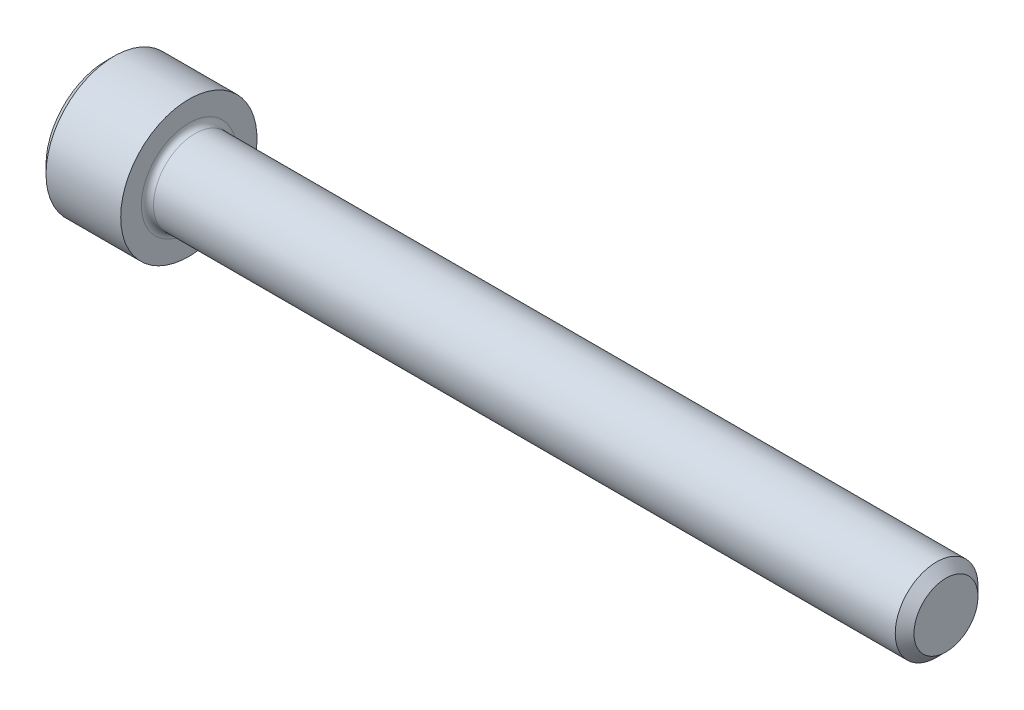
ISO-10303-21;
HEADER;
FILE_DESCRIPTION(('STEP AP214'),'2;1');
FILE_NAME('part.step','',(''),(''),'','','');
FILE_SCHEMA(('AUTOMOTIVE_DESIGN { 1 0 10303 214 1 1 1 1 }'));
ENDSEC;
DATA;
#1=APPLICATION_CONTEXT('core data for automotive mechanical design processes');
#2=APPLICATION_PROTOCOL_DEFINITION('international standard','automotive_design',2000,#1);
#3=PRODUCT_CONTEXT('',#1,'mechanical');
#4=PRODUCT('Part','Part','',(#3));
#5=PRODUCT_RELATED_PRODUCT_CATEGORY('part','',(#4));
#6=PRODUCT_DEFINITION_FORMATION('','',#4);
#7=PRODUCT_DEFINITION_CONTEXT('part definition',#1,'design');
#8=PRODUCT_DEFINITION('design','',#6,#7);
#9=PRODUCT_DEFINITION_SHAPE('','',#8);
#10=(LENGTH_UNIT() NAMED_UNIT(*) SI_UNIT(.MILLI.,.METRE.));
#11=(NAMED_UNIT(*) PLANE_ANGLE_UNIT() SI_UNIT($,.RADIAN.));
#12=(NAMED_UNIT(*) SI_UNIT($,.STERADIAN.) SOLID_ANGLE_UNIT());
#13=UNCERTAINTY_MEASURE_WITH_UNIT(LENGTH_MEASURE(1.E-05),#10,'distance_accuracy_value','');
#14=(GEOMETRIC_REPRESENTATION_CONTEXT(3) GLOBAL_UNCERTAINTY_ASSIGNED_CONTEXT((#13)) GLOBAL_UNIT_ASSIGNED_CONTEXT((#10,
#11,#12)) REPRESENTATION_CONTEXT('',''));
#15=CARTESIAN_POINT('',(0.,0.,0.));
#16=DIRECTION('',(0.,0.,1.));
#17=DIRECTION('',(1.,0.,0.));
#18=AXIS2_PLACEMENT_3D('',#15,#16,#17);
#19=CARTESIAN_POINT('',(0.,0.,0.));
#20=DIRECTION('',(-1.,0.,0.));
#21=DIRECTION('',(0.,0.,1.));
#22=AXIS2_PLACEMENT_3D('',#19,#20,#21);
#23=PLANE('',#22);
#24=DIRECTION('',(0.,-0.499999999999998,0.86602540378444));
#25=VECTOR('',#24,1.);
#26=CARTESIAN_POINT('',(0.,2.05305755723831,0.));
#27=LINE('',#26,#25);
#28=CARTESIAN_POINT('',(0.,2.05305755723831,0.));
#29=VERTEX_POINT('',#28);
#30=CARTESIAN_POINT('',(0.,1.02652877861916,1.778));
#31=VERTEX_POINT('',#30);
#32=EDGE_CURVE('E402',#29,#31,#27,.T.);
#33=ORIENTED_EDGE('',*,*,#32,.T.);
#34=DIRECTION('',(0.,1.,0.));
#35=VECTOR('',#34,1.);
#36=CARTESIAN_POINT('',(0.,-1.02652877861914,1.778));
#37=LINE('',#36,#35);
#38=CARTESIAN_POINT('',(0.,-1.02652877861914,1.778));
#39=VERTEX_POINT('',#38);
#40=EDGE_CURVE('E149',#39,#31,#37,.T.);
#41=ORIENTED_EDGE('',*,*,#40,.F.);
#42=DIRECTION('',(0.,-0.500000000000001,-0.866025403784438));
#43=VECTOR('',#42,1.);
#44=CARTESIAN_POINT('',(0.,-1.02652877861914,1.778));
#45=LINE('',#44,#43);
#46=CARTESIAN_POINT('',(0.,-2.0530575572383,0.));
#47=VERTEX_POINT('',#46);
#48=EDGE_CURVE('E407',#39,#47,#45,.T.);
#49=ORIENTED_EDGE('',*,*,#48,.T.);
#50=DIRECTION('',(0.,0.499999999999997,-0.86602540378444));
#51=VECTOR('',#50,1.);
#52=CARTESIAN_POINT('',(0.,-2.0530575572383,0.));
#53=LINE('',#52,#51);
#54=CARTESIAN_POINT('',(0.,-1.02652877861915,-1.778));
#55=VERTEX_POINT('',#54);
#56=EDGE_CURVE('E411',#47,#55,#53,.T.);
#57=ORIENTED_EDGE('',*,*,#56,.T.);
#58=DIRECTION('',(0.,-1.,0.));
#59=VECTOR('',#58,1.);
#60=CARTESIAN_POINT('',(0.,1.02652877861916,-1.778));
#61=LINE('',#60,#59);
#62=CARTESIAN_POINT('',(0.,1.02652877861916,-1.778));
#63=VERTEX_POINT('',#62);
#64=EDGE_CURVE('E415',#63,#55,#61,.T.);
#65=ORIENTED_EDGE('',*,*,#64,.F.);
#66=DIRECTION('',(0.,-0.500000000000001,-0.866025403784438));
#67=VECTOR('',#66,1.);
#68=CARTESIAN_POINT('',(0.,2.05305755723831,0.));
#69=LINE('',#68,#67);
#70=EDGE_CURVE('E144',#29,#63,#69,.T.);
#71=ORIENTED_EDGE('',*,*,#70,.F.);
#72=EDGE_LOOP('',(#33,#41,#49,#57,#65,#71));
#73=FACE_BOUND('',#72,.T.);
#74=CARTESIAN_POINT('',(0.,0.,0.));
#75=DIRECTION('',(-1.,0.,0.));
#76=DIRECTION('',(0.,0.,1.));
#77=AXIS2_PLACEMENT_3D('',#74,#75,#76);
#78=CIRCLE('',#77,3.0226);
#79=CARTESIAN_POINT('',(0.,0.,3.0226));
#80=VERTEX_POINT('',#79);
#81=EDGE_CURVE('E164',#80,#80,#78,.T.);
#82=ORIENTED_EDGE('',*,*,#81,.T.);
#83=EDGE_LOOP('',(#82));
#84=FACE_BOUND('',#83,.T.);
#85=ADVANCED_FACE('F37',(#73,#84),#23,.T.);
#86=CARTESIAN_POINT('',(42.2656,1.61036,0.));
#87=DIRECTION('',(1.,0.,0.));
#88=DIRECTION('',(0.,0.,-1.));
#89=AXIS2_PLACEMENT_3D('',#86,#87,#88);
#90=PLANE('',#89);
#91=CARTESIAN_POINT('',(42.2656,0.,0.));
#92=DIRECTION('',(-1.,0.,0.));
#93=DIRECTION('',(0.,0.,1.));
#94=AXIS2_PLACEMENT_3D('',#91,#92,#93);
#95=CIRCLE('',#94,1.61036);
#96=CARTESIAN_POINT('',(42.2656,0.,1.61036));
#97=VERTEX_POINT('',#96);
#98=EDGE_CURVE('E180',#97,#97,#95,.T.);
#99=ORIENTED_EDGE('',*,*,#98,.F.);
#100=EDGE_LOOP('',(#99));
#101=FACE_BOUND('',#100,.T.);
#102=ADVANCED_FACE('F202',(#101),#90,.T.);
#103=CARTESIAN_POINT('',(42.2656,0.,0.));
#104=DIRECTION('',(-1.,0.,0.));
#105=DIRECTION('',(0.,0.,1.));
#106=AXIS2_PLACEMENT_3D('',#103,#104,#105);
#107=CONICAL_SURFACE('',#106,1.61036,0.785398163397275);
#108=CARTESIAN_POINT('',(41.7931599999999,0.,0.));
#109=DIRECTION('',(-1.,0.,0.));
#110=DIRECTION('',(0.,0.,1.));
#111=AXIS2_PLACEMENT_3D('',#108,#109,#110);
#112=CIRCLE('',#111,2.08279999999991);
#113=CARTESIAN_POINT('',(41.7931599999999,0.,2.08279999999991));
#114=VERTEX_POINT('',#113);
#115=EDGE_CURVE('E177',#114,#114,#112,.T.);
#116=ORIENTED_EDGE('',*,*,#115,.F.);
#117=EDGE_LOOP('',(#116));
#118=FACE_BOUND('',#117,.T.);
#119=ORIENTED_EDGE('',*,*,#98,.T.);
#120=EDGE_LOOP('',(#119));
#121=FACE_BOUND('',#120,.T.);
#122=ADVANCED_FACE('F208',(#118,#121),#107,.T.);
#123=CARTESIAN_POINT('',(-31.75,0.,0.));
#124=DIRECTION('',(-1.,0.,0.));
#125=DIRECTION('',(0.,0.,1.));
#126=AXIS2_PLACEMENT_3D('',#123,#124,#125);
#127=CYLINDRICAL_SURFACE('',#126,2.08279999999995);
#128=CARTESIAN_POINT('',(4.4704,0.,0.));
#129=DIRECTION('',(1.,0.,0.));
#130=DIRECTION('',(0.,0.,-1.));
#131=AXIS2_PLACEMENT_3D('',#128,#129,#130);
#132=CIRCLE('',#131,2.08279999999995);
#133=CARTESIAN_POINT('',(4.4704,0.,-2.08279999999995));
#134=VERTEX_POINT('',#133);
#135=EDGE_CURVE('E11',#134,#134,#132,.T.);
#136=ORIENTED_EDGE('',*,*,#135,.T.);
#137=EDGE_LOOP('',(#136));
#138=FACE_BOUND('',#137,.T.);
#139=ORIENTED_EDGE('',*,*,#115,.T.);
#140=EDGE_LOOP('',(#139));
#141=FACE_BOUND('',#140,.T.);
#142=ADVANCED_FACE('F219',(#138,#141),#127,.T.);
#143=CARTESIAN_POINT('',(4.1656,3.429,0.));
#144=DIRECTION('',(1.,0.,0.));
#145=DIRECTION('',(0.,0.,-1.));
#146=AXIS2_PLACEMENT_3D('',#143,#144,#145);
#147=PLANE('',#146);
#148=CARTESIAN_POINT('',(4.1656,0.,0.));
#149=DIRECTION('',(1.,0.,0.));
#150=DIRECTION('',(0.,0.,-1.));
#151=AXIS2_PLACEMENT_3D('',#148,#149,#150);
#152=CIRCLE('',#151,2.38759999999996);
#153=CARTESIAN_POINT('',(4.1656,0.,-2.38759999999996));
#154=VERTEX_POINT('',#153);
#155=EDGE_CURVE('E46',#154,#154,#152,.F.);
#156=ORIENTED_EDGE('',*,*,#155,.T.);
#157=EDGE_LOOP('',(#156));
#158=FACE_BOUND('',#157,.T.);
#159=CARTESIAN_POINT('',(4.1656,0.,0.));
#160=DIRECTION('',(-1.,0.,0.));
#161=DIRECTION('',(0.,0.,1.));
#162=AXIS2_PLACEMENT_3D('',#159,#160,#161);
#163=CIRCLE('',#162,3.429);
#164=CARTESIAN_POINT('',(4.1656,0.,3.429));
#165=VERTEX_POINT('',#164);
#166=EDGE_CURVE('E173',#165,#165,#163,.T.);
#167=ORIENTED_EDGE('',*,*,#166,.F.);
#168=EDGE_LOOP('',(#167));
#169=FACE_BOUND('',#168,.T.);
#170=ADVANCED_FACE('F186',(#158,#169),#147,.T.);
#171=CARTESIAN_POINT('',(-31.75,0.,0.));
#172=DIRECTION('',(-1.,0.,0.));
#173=DIRECTION('',(0.,0.,1.));
#174=AXIS2_PLACEMENT_3D('',#171,#172,#173);
#175=CYLINDRICAL_SURFACE('',#174,3.429);
#176=ORIENTED_EDGE('',*,*,#166,.T.);
#177=EDGE_LOOP('',(#176));
#178=FACE_BOUND('',#177,.T.);
#179=CARTESIAN_POINT('',(0.406400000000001,0.,0.));
#180=DIRECTION('',(-1.,0.,0.));
#181=DIRECTION('',(0.,0.,1.));
#182=AXIS2_PLACEMENT_3D('',#179,#180,#181);
#183=CIRCLE('',#182,3.429);
#184=CARTESIAN_POINT('',(0.406400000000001,0.,3.429));
#185=VERTEX_POINT('',#184);
#186=EDGE_CURVE('E169',#185,#185,#183,.T.);
#187=ORIENTED_EDGE('',*,*,#186,.F.);
#188=EDGE_LOOP('',(#187));
#189=FACE_BOUND('',#188,.T.);
#190=ADVANCED_FACE('F197',(#178,#189),#175,.T.);
#191=CARTESIAN_POINT('',(0.,0.,0.));
#192=DIRECTION('',(1.,0.,0.));
#193=DIRECTION('',(0.,0.,-1.));
#194=AXIS2_PLACEMENT_3D('',#191,#192,#193);
#195=CONICAL_SURFACE('',#194,3.0226,0.785398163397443);
#196=ORIENTED_EDGE('',*,*,#186,.T.);
#197=EDGE_LOOP('',(#196));
#198=FACE_BOUND('',#197,.T.);
#199=ORIENTED_EDGE('',*,*,#81,.F.);
#200=EDGE_LOOP('',(#199));
#201=FACE_BOUND('',#200,.T.);
#202=ADVANCED_FACE('F190',(#198,#201),#195,.T.);
#203=CARTESIAN_POINT('',(4.4704,0.,0.));
#204=DIRECTION('',(1.,0.,0.));
#205=DIRECTION('',(0.,0.,-1.));
#206=AXIS2_PLACEMENT_3D('',#203,#204,#205);
#207=TOROIDAL_SURFACE('',#206,2.38759999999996,0.3048);
#208=ORIENTED_EDGE('',*,*,#135,.F.);
#209=EDGE_LOOP('',(#208));
#210=FACE_BOUND('',#209,.T.);
#211=ORIENTED_EDGE('',*,*,#155,.F.);
#212=EDGE_LOOP('',(#211));
#213=FACE_BOUND('',#212,.T.);
#214=ADVANCED_FACE('F39',(#210,#213),#207,.F.);
#215=CARTESIAN_POINT('',(1.9558,2.05305755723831,0.));
#216=DIRECTION('',(0.,-0.86602540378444,-0.499999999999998));
#217=DIRECTION('',(0.,0.499999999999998,-0.86602540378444));
#218=AXIS2_PLACEMENT_3D('',#215,#216,#217);
#219=PLANE('',#218);
#220=ORIENTED_EDGE('',*,*,#32,.F.);
#221=DIRECTION('',(-1.,0.,0.));
#222=VECTOR('',#221,1.);
#223=CARTESIAN_POINT('',(1.9558,2.05305755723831,0.));
#224=LINE('',#223,#222);
#225=CARTESIAN_POINT('',(1.9558,2.05305755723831,0.));
#226=VERTEX_POINT('',#225);
#227=EDGE_CURVE('E391',#226,#29,#224,.T.);
#228=ORIENTED_EDGE('',*,*,#227,.F.);
#229=DIRECTION('',(0.,-0.499999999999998,0.86602540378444));
#230=VECTOR('',#229,1.);
#231=CARTESIAN_POINT('',(1.9558,2.05305755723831,0.));
#232=LINE('',#231,#230);
#233=CARTESIAN_POINT('',(1.9558,1.53979316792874,0.888999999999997));
#234=VERTEX_POINT('',#233);
#235=EDGE_CURVE('E135',#226,#234,#232,.T.);
#236=ORIENTED_EDGE('',*,*,#235,.T.);
#237=CARTESIAN_POINT('',(1.9558,1.02652877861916,1.778));
#238=VERTEX_POINT('',#237);
#239=EDGE_CURVE('E125',#234,#238,#232,.T.);
#240=ORIENTED_EDGE('',*,*,#239,.T.);
#241=DIRECTION('',(-1.,0.,0.));
#242=VECTOR('',#241,1.);
#243=CARTESIAN_POINT('',(1.9558,1.02652877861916,1.778));
#244=LINE('',#243,#242);
#245=EDGE_CURVE('E140',#238,#31,#244,.T.);
#246=ORIENTED_EDGE('',*,*,#245,.T.);
#247=EDGE_LOOP('',(#220,#228,#236,#240,#246));
#248=FACE_BOUND('',#247,.T.);
#249=ADVANCED_FACE('F139',(#248),#219,.T.);
#250=CARTESIAN_POINT('',(1.9558,-1.02652877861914,1.778));
#251=DIRECTION('',(0.,0.,1.));
#252=DIRECTION('',(0.,-1.,0.));
#253=AXIS2_PLACEMENT_3D('',#250,#251,#252);
#254=PLANE('',#253);
#255=ORIENTED_EDGE('',*,*,#40,.T.);
#256=ORIENTED_EDGE('',*,*,#245,.F.);
#257=DIRECTION('',(0.,1.,0.));
#258=VECTOR('',#257,1.);
#259=CARTESIAN_POINT('',(1.9558,-1.02652877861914,1.778));
#260=LINE('',#259,#258);
#261=CARTESIAN_POINT('',(1.9558,0.,1.778));
#262=VERTEX_POINT('',#261);
#263=EDGE_CURVE('E122',#262,#238,#260,.T.);
#264=ORIENTED_EDGE('',*,*,#263,.F.);
#265=CARTESIAN_POINT('',(1.9558,-1.02652877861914,1.778));
#266=VERTEX_POINT('',#265);
#267=EDGE_CURVE('E134',#266,#262,#260,.T.);
#268=ORIENTED_EDGE('',*,*,#267,.F.);
#269=DIRECTION('',(-1.,0.,0.));
#270=VECTOR('',#269,1.);
#271=CARTESIAN_POINT('',(1.9558,-1.02652877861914,1.778));
#272=LINE('',#271,#270);
#273=EDGE_CURVE('E152',#266,#39,#272,.T.);
#274=ORIENTED_EDGE('',*,*,#273,.T.);
#275=EDGE_LOOP('',(#255,#256,#264,#268,#274));
#276=FACE_BOUND('',#275,.T.);
#277=ADVANCED_FACE('F146',(#276),#254,.F.);
#278=CARTESIAN_POINT('',(1.9558,-1.02652877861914,1.778));
#279=DIRECTION('',(0.,0.866025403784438,-0.500000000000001));
#280=DIRECTION('',(0.,0.500000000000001,0.866025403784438));
#281=AXIS2_PLACEMENT_3D('',#278,#279,#280);
#282=PLANE('',#281);
#283=ORIENTED_EDGE('',*,*,#48,.F.);
#284=ORIENTED_EDGE('',*,*,#273,.F.);
#285=DIRECTION('',(0.,-0.500000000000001,-0.866025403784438));
#286=VECTOR('',#285,1.);
#287=CARTESIAN_POINT('',(1.9558,-1.02652877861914,1.778));
#288=LINE('',#287,#286);
#289=CARTESIAN_POINT('',(1.9558,-1.53979316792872,0.888999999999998));
#290=VERTEX_POINT('',#289);
#291=EDGE_CURVE('E445',#266,#290,#288,.T.);
#292=ORIENTED_EDGE('',*,*,#291,.T.);
#293=CARTESIAN_POINT('',(1.9558,-2.0530575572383,0.));
#294=VERTEX_POINT('',#293);
#295=EDGE_CURVE('E428',#290,#294,#288,.T.);
#296=ORIENTED_EDGE('',*,*,#295,.T.);
#297=DIRECTION('',(-1.,0.,0.));
#298=VECTOR('',#297,1.);
#299=CARTESIAN_POINT('',(1.9558,-2.0530575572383,0.));
#300=LINE('',#299,#298);
#301=EDGE_CURVE('E160',#294,#47,#300,.T.);
#302=ORIENTED_EDGE('',*,*,#301,.T.);
#303=EDGE_LOOP('',(#283,#284,#292,#296,#302));
#304=FACE_BOUND('',#303,.T.);
#305=ADVANCED_FACE('F282',(#304),#282,.T.);
#306=CARTESIAN_POINT('',(1.9558,-2.0530575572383,0.));
#307=DIRECTION('',(0.,0.86602540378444,0.499999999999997));
#308=DIRECTION('',(0.,-0.499999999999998,0.86602540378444));
#309=AXIS2_PLACEMENT_3D('',#306,#307,#308);
#310=PLANE('',#309);
#311=ORIENTED_EDGE('',*,*,#56,.F.);
#312=ORIENTED_EDGE('',*,*,#301,.F.);
#313=DIRECTION('',(0.,0.499999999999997,-0.86602540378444));
#314=VECTOR('',#313,1.);
#315=CARTESIAN_POINT('',(1.9558,-2.0530575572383,0.));
#316=LINE('',#315,#314);
#317=CARTESIAN_POINT('',(1.9558,-1.53979316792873,-0.888999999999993));
#318=VERTEX_POINT('',#317);
#319=EDGE_CURVE('E397',#294,#318,#316,.T.);
#320=ORIENTED_EDGE('',*,*,#319,.T.);
#321=CARTESIAN_POINT('',(1.9558,-1.02652877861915,-1.778));
#322=VERTEX_POINT('',#321);
#323=EDGE_CURVE('E444',#318,#322,#316,.T.);
#324=ORIENTED_EDGE('',*,*,#323,.T.);
#325=DIRECTION('',(-1.,0.,0.));
#326=VECTOR('',#325,1.);
#327=CARTESIAN_POINT('',(1.9558,-1.02652877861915,-1.778));
#328=LINE('',#327,#326);
#329=EDGE_CURVE('E390',#322,#55,#328,.T.);
#330=ORIENTED_EDGE('',*,*,#329,.T.);
#331=EDGE_LOOP('',(#311,#312,#320,#324,#330));
#332=FACE_BOUND('',#331,.T.);
#333=ADVANCED_FACE('F290',(#332),#310,.T.);
#334=CARTESIAN_POINT('',(1.9558,1.02652877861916,-1.778));
#335=DIRECTION('',(0.,0.,-1.));
#336=DIRECTION('',(0.,1.,0.));
#337=AXIS2_PLACEMENT_3D('',#334,#335,#336);
#338=PLANE('',#337);
#339=ORIENTED_EDGE('',*,*,#64,.T.);
#340=ORIENTED_EDGE('',*,*,#329,.F.);
#341=DIRECTION('',(0.,-1.,0.));
#342=VECTOR('',#341,1.);
#343=CARTESIAN_POINT('',(1.9558,1.02652877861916,-1.778));
#344=LINE('',#343,#342);
#345=CARTESIAN_POINT('',(1.9558,0.,-1.778));
#346=VERTEX_POINT('',#345);
#347=EDGE_CURVE('E394',#346,#322,#344,.T.);
#348=ORIENTED_EDGE('',*,*,#347,.F.);
#349=CARTESIAN_POINT('',(1.9558,1.02652877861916,-1.778));
#350=VERTEX_POINT('',#349);
#351=EDGE_CURVE('E53',#350,#346,#344,.T.);
#352=ORIENTED_EDGE('',*,*,#351,.F.);
#353=DIRECTION('',(-1.,0.,0.));
#354=VECTOR('',#353,1.);
#355=CARTESIAN_POINT('',(1.9558,1.02652877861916,-1.778));
#356=LINE('',#355,#354);
#357=EDGE_CURVE('E387',#350,#63,#356,.T.);
#358=ORIENTED_EDGE('',*,*,#357,.T.);
#359=EDGE_LOOP('',(#339,#340,#348,#352,#358));
#360=FACE_BOUND('',#359,.T.);
#361=ADVANCED_FACE('F299',(#360),#338,.F.);
#362=CARTESIAN_POINT('',(1.9558,2.05305755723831,0.));
#363=DIRECTION('',(0.,0.866025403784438,-0.500000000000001));
#364=DIRECTION('',(0.,0.500000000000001,0.866025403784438));
#365=AXIS2_PLACEMENT_3D('',#362,#363,#364);
#366=PLANE('',#365);
#367=ORIENTED_EDGE('',*,*,#70,.T.);
#368=ORIENTED_EDGE('',*,*,#357,.F.);
#369=DIRECTION('',(0.,-0.500000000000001,-0.866025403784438));
#370=VECTOR('',#369,1.);
#371=CARTESIAN_POINT('',(1.9558,2.05305755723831,0.));
#372=LINE('',#371,#370);
#373=CARTESIAN_POINT('',(1.9558,1.53979316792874,-0.889000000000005));
#374=VERTEX_POINT('',#373);
#375=EDGE_CURVE('E377',#374,#350,#372,.T.);
#376=ORIENTED_EDGE('',*,*,#375,.F.);
#377=EDGE_CURVE('E383',#226,#374,#372,.T.);
#378=ORIENTED_EDGE('',*,*,#377,.F.);
#379=ORIENTED_EDGE('',*,*,#227,.T.);
#380=EDGE_LOOP('',(#367,#368,#376,#378,#379));
#381=FACE_BOUND('',#380,.T.);
#382=ADVANCED_FACE('F308',(#381),#366,.F.);
#383=CARTESIAN_POINT('',(1.9558,3.07958633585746,-1.77800000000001));
#384=DIRECTION('',(1.,0.,0.));
#385=DIRECTION('',(0.,0.,-1.));
#386=AXIS2_PLACEMENT_3D('',#383,#384,#385);
#387=PLANE('',#386);
#388=ORIENTED_EDGE('',*,*,#347,.T.);
#389=ORIENTED_EDGE('',*,*,#323,.F.);
#390=CARTESIAN_POINT('',(1.9558,0.,0.));
#391=DIRECTION('',(-1.,0.,0.));
#392=DIRECTION('',(0.,0.,1.));
#393=AXIS2_PLACEMENT_3D('',#390,#391,#392);
#394=CIRCLE('',#393,1.778);
#395=EDGE_CURVE('E437',#346,#318,#394,.T.);
#396=ORIENTED_EDGE('',*,*,#395,.F.);
#397=EDGE_LOOP('',(#388,#389,#396));
#398=FACE_BOUND('',#397,.T.);
#399=ADVANCED_FACE('F317',(#398),#387,.F.);
#400=ORIENTED_EDGE('',*,*,#319,.F.);
#401=ORIENTED_EDGE('',*,*,#295,.F.);
#402=EDGE_CURVE('E157',#318,#290,#394,.T.);
#403=ORIENTED_EDGE('',*,*,#402,.F.);
#404=EDGE_LOOP('',(#400,#401,#403));
#405=FACE_BOUND('',#404,.T.);
#406=ADVANCED_FACE('F326',(#405),#387,.F.);
#407=ORIENTED_EDGE('',*,*,#291,.F.);
#408=ORIENTED_EDGE('',*,*,#267,.T.);
#409=EDGE_CURVE('E151',#290,#262,#394,.T.);
#410=ORIENTED_EDGE('',*,*,#409,.F.);
#411=EDGE_LOOP('',(#407,#408,#410));
#412=FACE_BOUND('',#411,.T.);
#413=ADVANCED_FACE('F335',(#412),#387,.F.);
#414=ORIENTED_EDGE('',*,*,#263,.T.);
#415=ORIENTED_EDGE('',*,*,#239,.F.);
#416=EDGE_CURVE('E128',#262,#234,#394,.T.);
#417=ORIENTED_EDGE('',*,*,#416,.F.);
#418=EDGE_LOOP('',(#414,#415,#417));
#419=FACE_BOUND('',#418,.T.);
#420=ADVANCED_FACE('F124',(#419),#387,.F.);
#421=ORIENTED_EDGE('',*,*,#235,.F.);
#422=ORIENTED_EDGE('',*,*,#377,.T.);
#423=EDGE_CURVE('E165',#234,#374,#394,.T.);
#424=ORIENTED_EDGE('',*,*,#423,.F.);
#425=EDGE_LOOP('',(#421,#422,#424));
#426=FACE_BOUND('',#425,.T.);
#427=ADVANCED_FACE('F350',(#426),#387,.F.);
#428=ORIENTED_EDGE('',*,*,#375,.T.);
#429=ORIENTED_EDGE('',*,*,#351,.T.);
#430=EDGE_CURVE('E380',#374,#346,#394,.T.);
#431=ORIENTED_EDGE('',*,*,#430,.F.);
#432=EDGE_LOOP('',(#428,#429,#431));
#433=FACE_BOUND('',#432,.T.);
#434=ADVANCED_FACE('F265',(#433),#387,.F.);
#435=CARTESIAN_POINT('',(1.9558,0.,0.));
#436=DIRECTION('',(-1.,0.,0.));
#437=DIRECTION('',(0.,0.,1.));
#438=AXIS2_PLACEMENT_3D('',#435,#436,#437);
#439=CONICAL_SURFACE('',#438,1.778,1.04719755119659);
#440=CARTESIAN_POINT('',(2.98232877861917,0.,0.));
#441=VERTEX_POINT('',#440);
#442=VERTEX_LOOP('',#441);
#443=FACE_BOUND('',#442,.T.);
#444=ORIENTED_EDGE('',*,*,#416,.T.);
#445=ORIENTED_EDGE('',*,*,#423,.T.);
#446=ORIENTED_EDGE('',*,*,#430,.T.);
#447=ORIENTED_EDGE('',*,*,#395,.T.);
#448=ORIENTED_EDGE('',*,*,#402,.T.);
#449=ORIENTED_EDGE('',*,*,#409,.T.);
#450=EDGE_LOOP('',(#444,#445,#446,#447,#448,#449));
#451=FACE_BOUND('',#450,.T.);
#452=ADVANCED_FACE('F212',(#443,#451),#439,.F.);
#453=CLOSED_SHELL('',(#85,#102,#122,#142,#170,#190,#202,#214,#249,#277,#305,#333,#361,#382,#399,
#406,#413,#420,#427,#434,#452));
#454=MANIFOLD_SOLID_BREP('B2',#453);
#455=ADVANCED_BREP_SHAPE_REPRESENTATION('',(#18,#454),#14);
#456=SHAPE_DEFINITION_REPRESENTATION(#9,#455);
ENDSEC;
END-ISO-10303-21;
